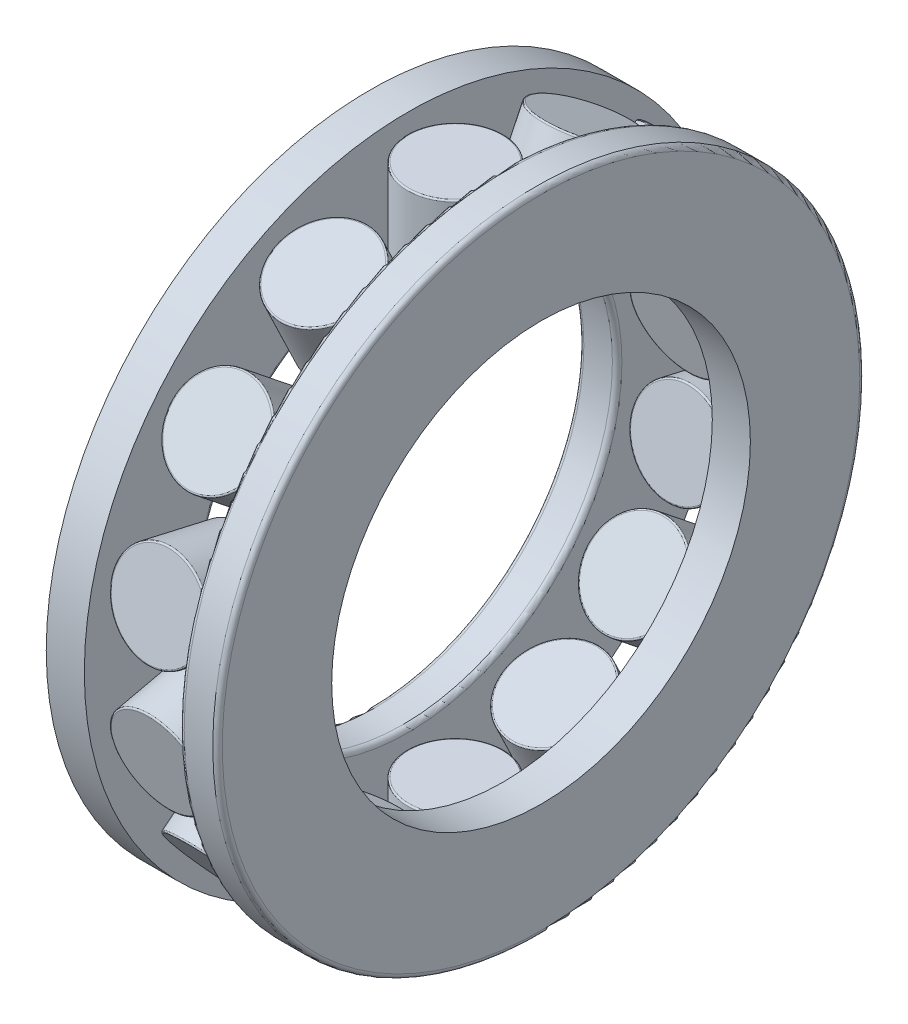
from build123d import *

# Parameters (mm, degrees)
INNRACSKE_W           = 6.35
INNRACSKE_H           = 19.05
FILLET_2_R            = 0.79375
ROLLERSDETAILED_COUNT = 14
ROLLERSDETAILED_ANGLE = 334.285714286


with BuildPart() as part:
    # InnRacSke → Race (revolve)
    with BuildSketch(Plane.XY, mode=Mode.PRIVATE) as race_sk:
        with Locations((-11.1125, 44.45)):
            Rectangle(INNRACSKE_W, INNRACSKE_H)
    race = revolve(race_sk.sketch.rotate(Axis((-34.925, 0, 0), (1, 0, 0)), 270), axis=Axis((-34.925, 0, 0), (1, 0, 0)))

    # RolDetSke → RollerDetailed (revolve)
    with BuildSketch(Plane.XY, mode=Mode.PRIVATE) as rollerdetailed_sk:
        with BuildLine():
            Line((0, 50.8), (7.7231875, 50.8))
            ThreePointArc((7.7231875, 50.8), (7.902792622, 50.725605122), (7.9771875, 50.546))
            Line((7.9771875, 50.546), (7.9771875, 38.354))
            ThreePointArc((7.9771875, 38.354), (7.902792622, 38.174394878), (7.7231875, 38.1))
            Line((7.7231875, 38.1), (0, 38.1))
            Line((0, 38.1), (0, 50.8))
        make_face()
    rollerdetailed = revolve(rollerdetailed_sk.sketch.rotate(Axis((0, 33.02, 0), (0, 1, 0)), 270), axis=Axis((0, 33.02, 0), (0, 1, 0)))

    # Mirror1: Race across plane
    add(race.mirror(Plane(origin=(0, 0, 0), x_dir=(0, 0, 1), z_dir=(1, 0, 0))))

    # Fillet 2
    fillet_2_edges = [part.edges().sort_by_distance(p)[0] for p in [
        (14.2875, 0, 53.975),
        (7.9375, 0, 53.975),
        (-14.2875, 0, 34.925),
        (-7.9375, 0, 34.925),
    ]]
    fillet(fillet_2_edges, radius=FILLET_2_R)

    # RollersDetailed: RollerDetailed ×14 about axis
    rollersdetailed_axis = Axis((-50, 0, 0), (1, 0, 0))
    for i in range(1, ROLLERSDETAILED_COUNT):
        add(rollerdetailed.rotate(rollersdetailed_axis, i * ROLLERSDETAILED_ANGLE / (ROLLERSDETAILED_COUNT - 1)))


solid = part.part
